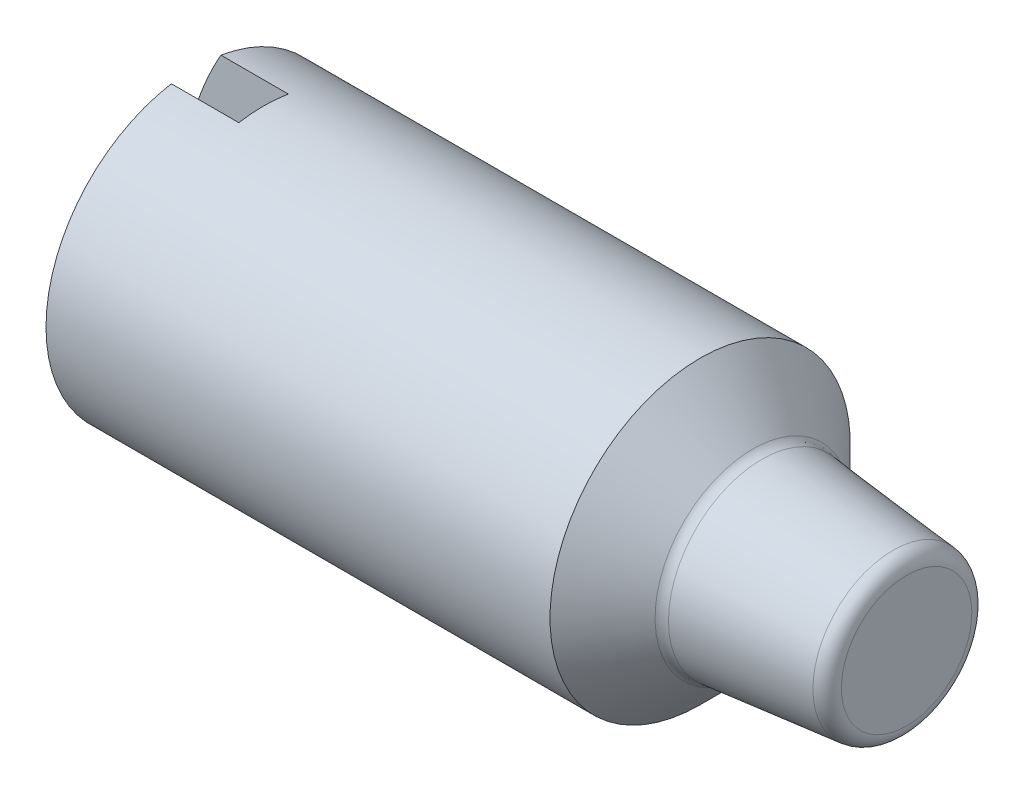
ISO-10303-21;
HEADER;
FILE_DESCRIPTION(('STEP AP214'),'2;1');
FILE_NAME('part.step','',(''),(''),'','','');
FILE_SCHEMA(('AUTOMOTIVE_DESIGN { 1 0 10303 214 1 1 1 1 }'));
ENDSEC;
DATA;
#1=APPLICATION_CONTEXT('core data for automotive mechanical design processes');
#2=APPLICATION_PROTOCOL_DEFINITION('international standard','automotive_design',2000,#1);
#3=PRODUCT_CONTEXT('',#1,'mechanical');
#4=PRODUCT('Part','Part','',(#3));
#5=PRODUCT_RELATED_PRODUCT_CATEGORY('part','',(#4));
#6=PRODUCT_DEFINITION_FORMATION('','',#4);
#7=PRODUCT_DEFINITION_CONTEXT('part definition',#1,'design');
#8=PRODUCT_DEFINITION('design','',#6,#7);
#9=PRODUCT_DEFINITION_SHAPE('','',#8);
#10=(LENGTH_UNIT() NAMED_UNIT(*) SI_UNIT(.MILLI.,.METRE.));
#11=(NAMED_UNIT(*) PLANE_ANGLE_UNIT() SI_UNIT($,.RADIAN.));
#12=(NAMED_UNIT(*) SI_UNIT($,.STERADIAN.) SOLID_ANGLE_UNIT());
#13=UNCERTAINTY_MEASURE_WITH_UNIT(LENGTH_MEASURE(1.E-05),#10,'distance_accuracy_value','');
#14=(GEOMETRIC_REPRESENTATION_CONTEXT(3) GLOBAL_UNCERTAINTY_ASSIGNED_CONTEXT((#13)) GLOBAL_UNIT_ASSIGNED_CONTEXT((#10,
#11,#12)) REPRESENTATION_CONTEXT('',''));
#15=CARTESIAN_POINT('',(0.,0.,0.));
#16=DIRECTION('',(0.,0.,1.));
#17=DIRECTION('',(1.,0.,0.));
#18=AXIS2_PLACEMENT_3D('',#15,#16,#17);
#19=CARTESIAN_POINT('',(4.,0.,0.));
#20=DIRECTION('',(-1.,0.,0.));
#21=DIRECTION('',(0.,1.,0.));
#22=AXIS2_PLACEMENT_3D('',#19,#20,#21);
#23=SPHERICAL_SURFACE('',#22,4.);
#24=CARTESIAN_POINT('',(0.535898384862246,0.,0.));
#25=DIRECTION('',(-1.,0.,0.));
#26=DIRECTION('',(0.,-1.,0.));
#27=AXIS2_PLACEMENT_3D('',#24,#25,#26);
#28=CIRCLE('',#27,2.);
#29=CARTESIAN_POINT('',(0.535898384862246,-1.97258713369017,0.330000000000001));
#30=VERTEX_POINT('',#29);
#31=CARTESIAN_POINT('',(0.535898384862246,1.97258713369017,0.330000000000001));
#32=VERTEX_POINT('',#31);
#33=EDGE_CURVE('E137',#30,#32,#28,.T.);
#34=ORIENTED_EDGE('',*,*,#33,.T.);
#35=CARTESIAN_POINT('',(4.,0.,0.330000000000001));
#36=DIRECTION('',(0.,0.,1.));
#37=DIRECTION('',(1.,0.,0.));
#38=AXIS2_PLACEMENT_3D('',#35,#36,#37);
#39=CIRCLE('',#38,3.9863642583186);
#40=EDGE_CURVE('E52',#32,#30,#39,.T.);
#41=ORIENTED_EDGE('',*,*,#40,.T.);
#42=EDGE_LOOP('',(#34,#41));
#43=FACE_BOUND('',#42,.T.);
#44=ADVANCED_FACE('F37',(#43),#23,.T.);
#45=CARTESIAN_POINT('',(10.,0.,0.));
#46=DIRECTION('',(-1.,0.,0.));
#47=DIRECTION('',(0.,-1.,0.));
#48=AXIS2_PLACEMENT_3D('',#45,#46,#47);
#49=PLANE('',#48);
#50=CARTESIAN_POINT('',(10.,0.,0.));
#51=DIRECTION('',(-1.,0.,0.));
#52=DIRECTION('',(0.,-1.,0.));
#53=AXIS2_PLACEMENT_3D('',#50,#51,#52);
#54=CIRCLE('',#53,0.869002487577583);
#55=CARTESIAN_POINT('',(10.,-0.869002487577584,0.));
#56=VERTEX_POINT('',#55);
#57=EDGE_CURVE('E45',#56,#56,#54,.F.);
#58=ORIENTED_EDGE('',*,*,#57,.T.);
#59=EDGE_LOOP('',(#58));
#60=FACE_BOUND('',#59,.T.);
#61=ADVANCED_FACE('F113',(#60),#49,.F.);
#62=CARTESIAN_POINT('',(10.,0.,0.));
#63=DIRECTION('',(-1.,0.,0.));
#64=DIRECTION('',(0.,-1.,0.));
#65=AXIS2_PLACEMENT_3D('',#62,#63,#64);
#66=CONICAL_SURFACE('',#65,1.05,0.0996686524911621);
#67=CARTESIAN_POINT('',(9.8199007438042,0.,0.));
#68=DIRECTION('',(1.,0.,0.));
#69=DIRECTION('',(0.,1.,0.));
#70=AXIS2_PLACEMENT_3D('',#67,#68,#69);
#71=CIRCLE('',#70,1.06800992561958);
#72=CARTESIAN_POINT('',(9.8199007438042,1.06800992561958,0.));
#73=VERTEX_POINT('',#72);
#74=EDGE_CURVE('E104',#73,#73,#71,.F.);
#75=ORIENTED_EDGE('',*,*,#74,.T.);
#76=EDGE_LOOP('',(#75));
#77=FACE_BOUND('',#76,.T.);
#78=CARTESIAN_POINT('',(8.07103836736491,0.,0.));
#79=DIRECTION('',(-1.,0.,0.));
#80=DIRECTION('',(0.,-1.,0.));
#81=AXIS2_PLACEMENT_3D('',#78,#79,#80);
#82=CIRCLE('',#81,1.24289616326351);
#83=CARTESIAN_POINT('',(8.07103836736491,-1.24289616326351,0.));
#84=VERTEX_POINT('',#83);
#85=EDGE_CURVE('E101',#84,#84,#82,.F.);
#86=ORIENTED_EDGE('',*,*,#85,.T.);
#87=EDGE_LOOP('',(#86));
#88=FACE_BOUND('',#87,.T.);
#89=ADVANCED_FACE('F120',(#77,#88),#66,.T.);
#90=CARTESIAN_POINT('',(8.,0.,0.));
#91=DIRECTION('',(-1.,0.,0.));
#92=DIRECTION('',(0.,-1.,0.));
#93=AXIS2_PLACEMENT_3D('',#90,#91,#92);
#94=CONICAL_SURFACE('',#93,1.25,0.785398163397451);
#95=CARTESIAN_POINT('',(7.9495177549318,0.,0.));
#96=DIRECTION('',(-1.,0.,0.));
#97=DIRECTION('',(0.,-1.,0.));
#98=AXIS2_PLACEMENT_3D('',#95,#96,#97);
#99=CIRCLE('',#98,1.3004822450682);
#100=CARTESIAN_POINT('',(7.9495177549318,-1.3004822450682,0.));
#101=VERTEX_POINT('',#100);
#102=EDGE_CURVE('E11',#101,#101,#99,.T.);
#103=ORIENTED_EDGE('',*,*,#102,.T.);
#104=EDGE_LOOP('',(#103));
#105=FACE_BOUND('',#104,.T.);
#106=CARTESIAN_POINT('',(7.25,0.,0.));
#107=DIRECTION('',(-1.,0.,0.));
#108=DIRECTION('',(0.,-1.,0.));
#109=AXIS2_PLACEMENT_3D('',#106,#107,#108);
#110=CIRCLE('',#109,2.);
#111=CARTESIAN_POINT('',(7.25,-2.,0.));
#112=VERTEX_POINT('',#111);
#113=EDGE_CURVE('E136',#112,#112,#110,.T.);
#114=ORIENTED_EDGE('',*,*,#113,.F.);
#115=EDGE_LOOP('',(#114));
#116=FACE_BOUND('',#115,.T.);
#117=ADVANCED_FACE('F123',(#105,#116),#94,.T.);
#118=CARTESIAN_POINT('',(-8.57033571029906,0.,0.));
#119=DIRECTION('',(-1.,0.,0.));
#120=DIRECTION('',(0.,-1.,0.));
#121=AXIS2_PLACEMENT_3D('',#118,#119,#120);
#122=CYLINDRICAL_SURFACE('',#121,2.);
#123=DIRECTION('',(-1.,0.,0.));
#124=VECTOR('',#123,1.);
#125=CARTESIAN_POINT('',(-8.57033571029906,-1.97258713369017,0.330000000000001));
#126=LINE('',#125,#124);
#127=CARTESIAN_POINT('',(1.4336357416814,-1.97258713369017,0.330000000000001));
#128=VERTEX_POINT('',#127);
#129=EDGE_CURVE('E57',#30,#128,#126,.F.);
#130=ORIENTED_EDGE('',*,*,#129,.T.);
#131=CARTESIAN_POINT('',(1.4336357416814,0.,0.));
#132=DIRECTION('',(1.,0.,0.));
#133=DIRECTION('',(0.,0.,-1.));
#134=AXIS2_PLACEMENT_3D('',#131,#132,#133);
#135=CIRCLE('',#134,2.);
#136=CARTESIAN_POINT('',(1.4336357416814,-1.97258713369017,-0.329999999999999));
#137=VERTEX_POINT('',#136);
#138=EDGE_CURVE('E93',#128,#137,#135,.T.);
#139=ORIENTED_EDGE('',*,*,#138,.T.);
#140=DIRECTION('',(-1.,0.,0.));
#141=VECTOR('',#140,1.);
#142=CARTESIAN_POINT('',(-8.57033571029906,-1.97258713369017,-0.329999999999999));
#143=LINE('',#142,#141);
#144=CARTESIAN_POINT('',(0.535898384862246,-1.97258713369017,-0.329999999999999));
#145=VERTEX_POINT('',#144);
#146=EDGE_CURVE('E77',#137,#145,#143,.T.);
#147=ORIENTED_EDGE('',*,*,#146,.T.);
#148=CARTESIAN_POINT('',(0.535898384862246,1.97258713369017,-0.329999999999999));
#149=VERTEX_POINT('',#148);
#150=EDGE_CURVE('E141',#149,#145,#28,.T.);
#151=ORIENTED_EDGE('',*,*,#150,.F.);
#152=DIRECTION('',(-1.,0.,0.));
#153=VECTOR('',#152,1.);
#154=CARTESIAN_POINT('',(-8.57033571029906,1.97258713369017,-0.329999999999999));
#155=LINE('',#154,#153);
#156=CARTESIAN_POINT('',(1.4336357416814,1.97258713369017,-0.329999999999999));
#157=VERTEX_POINT('',#156);
#158=EDGE_CURVE('E88',#149,#157,#155,.F.);
#159=ORIENTED_EDGE('',*,*,#158,.T.);
#160=CARTESIAN_POINT('',(1.4336357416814,1.97258713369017,0.330000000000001));
#161=VERTEX_POINT('',#160);
#162=EDGE_CURVE('E95',#157,#161,#135,.T.);
#163=ORIENTED_EDGE('',*,*,#162,.T.);
#164=DIRECTION('',(-1.,0.,0.));
#165=VECTOR('',#164,1.);
#166=CARTESIAN_POINT('',(-8.57033571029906,1.97258713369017,0.330000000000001));
#167=LINE('',#166,#165);
#168=EDGE_CURVE('E144',#161,#32,#167,.T.);
#169=ORIENTED_EDGE('',*,*,#168,.T.);
#170=ORIENTED_EDGE('',*,*,#33,.F.);
#171=EDGE_LOOP('',(#130,#139,#147,#151,#159,#163,#169,#170));
#172=FACE_BOUND('',#171,.T.);
#173=ORIENTED_EDGE('',*,*,#113,.T.);
#174=EDGE_LOOP('',(#173));
#175=FACE_BOUND('',#174,.T.);
#176=ADVANCED_FACE('F98',(#172,#175),#122,.T.);
#177=CARTESIAN_POINT('',(4.,0.,-0.329999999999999));
#178=DIRECTION('',(0.,0.,-1.));
#179=DIRECTION('',(-1.,0.,0.));
#180=AXIS2_PLACEMENT_3D('',#177,#178,#179);
#181=CIRCLE('',#180,3.9863642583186);
#182=EDGE_CURVE('E83',#145,#149,#181,.T.);
#183=ORIENTED_EDGE('',*,*,#182,.T.);
#184=ORIENTED_EDGE('',*,*,#150,.T.);
#185=EDGE_LOOP('',(#183,#184));
#186=FACE_BOUND('',#185,.T.);
#187=ADVANCED_FACE('F149',(#186),#23,.T.);
#188=CARTESIAN_POINT('',(1.4336357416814,-2.,-0.329999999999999));
#189=DIRECTION('',(1.,0.,0.));
#190=DIRECTION('',(0.,0.,-1.));
#191=AXIS2_PLACEMENT_3D('',#188,#189,#190);
#192=PLANE('',#191);
#193=DIRECTION('',(0.,1.,0.));
#194=VECTOR('',#193,1.);
#195=CARTESIAN_POINT('',(1.4336357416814,-2.,-0.329999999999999));
#196=LINE('',#195,#194);
#197=EDGE_CURVE('E81',#137,#157,#196,.T.);
#198=ORIENTED_EDGE('',*,*,#197,.F.);
#199=ORIENTED_EDGE('',*,*,#138,.F.);
#200=DIRECTION('',(0.,1.,0.));
#201=VECTOR('',#200,1.);
#202=CARTESIAN_POINT('',(1.4336357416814,-2.,0.330000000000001));
#203=LINE('',#202,#201);
#204=EDGE_CURVE('E96',#128,#161,#203,.T.);
#205=ORIENTED_EDGE('',*,*,#204,.T.);
#206=ORIENTED_EDGE('',*,*,#162,.F.);
#207=EDGE_LOOP('',(#198,#199,#205,#206));
#208=FACE_BOUND('',#207,.T.);
#209=ADVANCED_FACE('F91',(#208),#192,.F.);
#210=CARTESIAN_POINT('',(1.4336357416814,-2.,0.330000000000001));
#211=DIRECTION('',(0.,0.,1.));
#212=DIRECTION('',(1.,0.,0.));
#213=AXIS2_PLACEMENT_3D('',#210,#211,#212);
#214=PLANE('',#213);
#215=ORIENTED_EDGE('',*,*,#204,.F.);
#216=ORIENTED_EDGE('',*,*,#129,.F.);
#217=ORIENTED_EDGE('',*,*,#40,.F.);
#218=ORIENTED_EDGE('',*,*,#168,.F.);
#219=EDGE_LOOP('',(#215,#216,#217,#218));
#220=FACE_BOUND('',#219,.T.);
#221=ADVANCED_FACE('F156',(#220),#214,.F.);
#222=CARTESIAN_POINT('',(1.4336357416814,-2.,-0.329999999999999));
#223=DIRECTION('',(0.,0.,-1.));
#224=DIRECTION('',(-1.,0.,0.));
#225=AXIS2_PLACEMENT_3D('',#222,#223,#224);
#226=PLANE('',#225);
#227=ORIENTED_EDGE('',*,*,#197,.T.);
#228=ORIENTED_EDGE('',*,*,#158,.F.);
#229=ORIENTED_EDGE('',*,*,#182,.F.);
#230=ORIENTED_EDGE('',*,*,#146,.F.);
#231=EDGE_LOOP('',(#227,#228,#229,#230));
#232=FACE_BOUND('',#231,.T.);
#233=ADVANCED_FACE('F79',(#232),#226,.F.);
#234=CARTESIAN_POINT('',(9.8,0.,0.));
#235=DIRECTION('',(-1.,0.,0.));
#236=DIRECTION('',(0.,-1.,0.));
#237=AXIS2_PLACEMENT_3D('',#234,#235,#236);
#238=TOROIDAL_SURFACE('',#237,0.869002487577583,0.2);
#239=ORIENTED_EDGE('',*,*,#57,.F.);
#240=EDGE_LOOP('',(#239));
#241=FACE_BOUND('',#240,.T.);
#242=ORIENTED_EDGE('',*,*,#74,.F.);
#243=EDGE_LOOP('',(#242));
#244=FACE_BOUND('',#243,.T.);
#245=ADVANCED_FACE('F115',(#241,#244),#238,.T.);
#246=CARTESIAN_POINT('',(8.09093911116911,0.,0.));
#247=DIRECTION('',(-1.,0.,0.));
#248=DIRECTION('',(0.,-1.,0.));
#249=AXIS2_PLACEMENT_3D('',#246,#247,#248);
#250=TOROIDAL_SURFACE('',#249,1.44190360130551,0.2);
#251=ORIENTED_EDGE('',*,*,#85,.F.);
#252=EDGE_LOOP('',(#251));
#253=FACE_BOUND('',#252,.T.);
#254=ORIENTED_EDGE('',*,*,#102,.F.);
#255=EDGE_LOOP('',(#254));
#256=FACE_BOUND('',#255,.T.);
#257=ADVANCED_FACE('F39',(#253,#256),#250,.F.);
#258=CLOSED_SHELL('',(#44,#61,#89,#117,#176,#187,#209,#221,#233,#245,#257));
#259=MANIFOLD_SOLID_BREP('B2',#258);
#260=ADVANCED_BREP_SHAPE_REPRESENTATION('',(#18,#259),#14);
#261=SHAPE_DEFINITION_REPRESENTATION(#9,#260);
ENDSEC;
END-ISO-10303-21;
